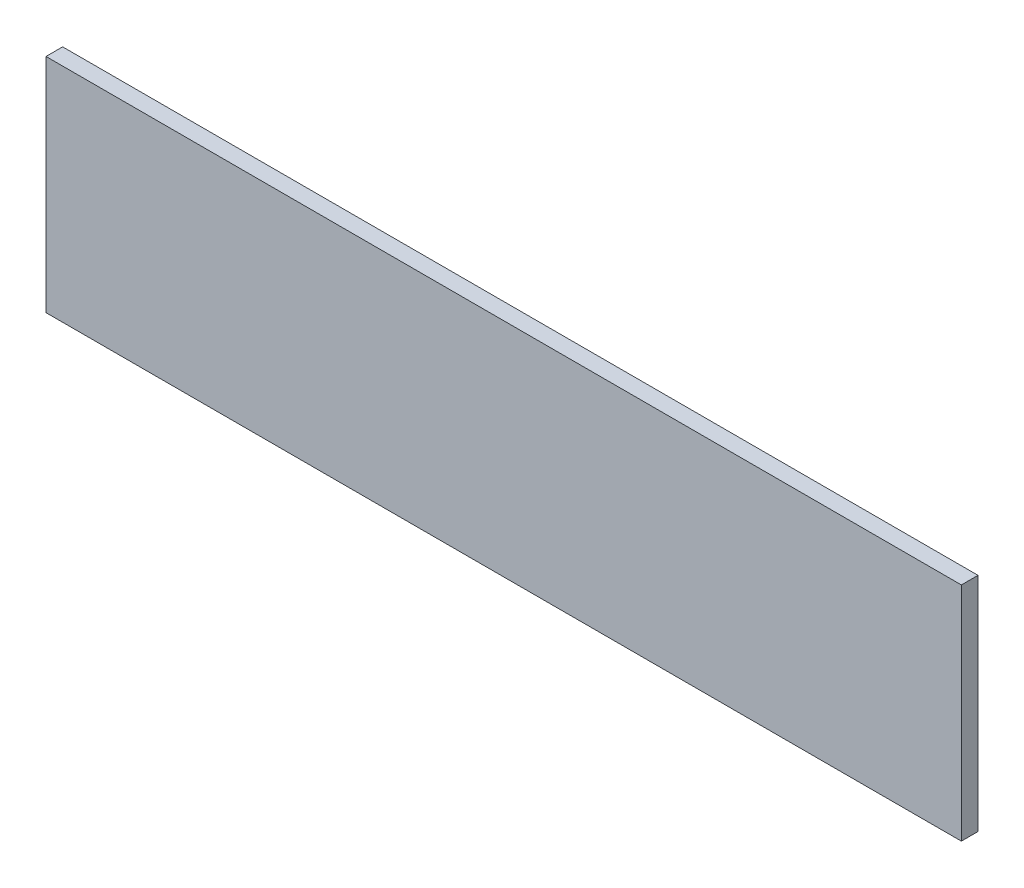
ISO-10303-21;
HEADER;
FILE_DESCRIPTION(('STEP AP214'),'2;1');
FILE_NAME('part.step','',(''),(''),'','','');
FILE_SCHEMA(('AUTOMOTIVE_DESIGN { 1 0 10303 214 1 1 1 1 }'));
ENDSEC;
DATA;
#1=APPLICATION_CONTEXT('core data for automotive mechanical design processes');
#2=APPLICATION_PROTOCOL_DEFINITION('international standard','automotive_design',2000,#1);
#3=PRODUCT_CONTEXT('',#1,'mechanical');
#4=PRODUCT('Part','Part','',(#3));
#5=PRODUCT_RELATED_PRODUCT_CATEGORY('part','',(#4));
#6=PRODUCT_DEFINITION_FORMATION('','',#4);
#7=PRODUCT_DEFINITION_CONTEXT('part definition',#1,'design');
#8=PRODUCT_DEFINITION('design','',#6,#7);
#9=PRODUCT_DEFINITION_SHAPE('','',#8);
#10=(LENGTH_UNIT() NAMED_UNIT(*) SI_UNIT(.MILLI.,.METRE.));
#11=(NAMED_UNIT(*) PLANE_ANGLE_UNIT() SI_UNIT($,.RADIAN.));
#12=(NAMED_UNIT(*) SI_UNIT($,.STERADIAN.) SOLID_ANGLE_UNIT());
#13=UNCERTAINTY_MEASURE_WITH_UNIT(LENGTH_MEASURE(1.E-05),#10,'distance_accuracy_value','');
#14=(GEOMETRIC_REPRESENTATION_CONTEXT(3) GLOBAL_UNCERTAINTY_ASSIGNED_CONTEXT((#13)) GLOBAL_UNIT_ASSIGNED_CONTEXT((#10,
#11,#12)) REPRESENTATION_CONTEXT('',''));
#15=CARTESIAN_POINT('',(0.,0.,0.));
#16=DIRECTION('',(0.,0.,1.));
#17=DIRECTION('',(1.,0.,0.));
#18=AXIS2_PLACEMENT_3D('',#15,#16,#17);
#19=CARTESIAN_POINT('',(82.5,-20.,3.));
#20=DIRECTION('',(-1.,0.,0.));
#21=DIRECTION('',(0.,0.,1.));
#22=AXIS2_PLACEMENT_3D('',#19,#20,#21);
#23=PLANE('',#22);
#24=DIRECTION('',(0.,1.,0.));
#25=VECTOR('',#24,1.);
#26=CARTESIAN_POINT('',(82.5,-20.,0.));
#27=LINE('',#26,#25);
#28=CARTESIAN_POINT('',(82.5,-20.,0.));
#29=VERTEX_POINT('',#28);
#30=CARTESIAN_POINT('',(82.5,20.,0.));
#31=VERTEX_POINT('',#30);
#32=EDGE_CURVE('E97',#29,#31,#27,.T.);
#33=ORIENTED_EDGE('',*,*,#32,.T.);
#34=DIRECTION('',(0.,0.,-1.));
#35=VECTOR('',#34,1.);
#36=CARTESIAN_POINT('',(82.5,20.,3.));
#37=LINE('',#36,#35);
#38=CARTESIAN_POINT('',(82.5,20.,3.));
#39=VERTEX_POINT('',#38);
#40=EDGE_CURVE('E11',#39,#31,#37,.T.);
#41=ORIENTED_EDGE('',*,*,#40,.F.);
#42=DIRECTION('',(0.,1.,0.));
#43=VECTOR('',#42,1.);
#44=CARTESIAN_POINT('',(82.5,-20.,3.));
#45=LINE('',#44,#43);
#46=CARTESIAN_POINT('',(82.5,-20.,3.));
#47=VERTEX_POINT('',#46);
#48=EDGE_CURVE('E85',#47,#39,#45,.T.);
#49=ORIENTED_EDGE('',*,*,#48,.F.);
#50=DIRECTION('',(0.,0.,-1.));
#51=VECTOR('',#50,1.);
#52=CARTESIAN_POINT('',(82.5,-20.,3.));
#53=LINE('',#52,#51);
#54=EDGE_CURVE('E93',#47,#29,#53,.T.);
#55=ORIENTED_EDGE('',*,*,#54,.T.);
#56=EDGE_LOOP('',(#33,#41,#49,#55));
#57=FACE_BOUND('',#56,.T.);
#58=ADVANCED_FACE('F34',(#57),#23,.F.);
#59=CARTESIAN_POINT('',(-82.5,20.,3.));
#60=DIRECTION('',(0.,-1.,0.));
#61=DIRECTION('',(0.,0.,-1.));
#62=AXIS2_PLACEMENT_3D('',#59,#60,#61);
#63=PLANE('',#62);
#64=DIRECTION('',(-1.,0.,0.));
#65=VECTOR('',#64,1.);
#66=CARTESIAN_POINT('',(-82.5,20.,0.));
#67=LINE('',#66,#65);
#68=CARTESIAN_POINT('',(-82.5,20.,0.));
#69=VERTEX_POINT('',#68);
#70=EDGE_CURVE('E89',#31,#69,#67,.T.);
#71=ORIENTED_EDGE('',*,*,#70,.T.);
#72=DIRECTION('',(0.,0.,-1.));
#73=VECTOR('',#72,1.);
#74=CARTESIAN_POINT('',(-82.5,20.,3.));
#75=LINE('',#74,#73);
#76=CARTESIAN_POINT('',(-82.5,20.,3.));
#77=VERTEX_POINT('',#76);
#78=EDGE_CURVE('E42',#77,#69,#75,.T.);
#79=ORIENTED_EDGE('',*,*,#78,.F.);
#80=DIRECTION('',(-1.,0.,0.));
#81=VECTOR('',#80,1.);
#82=CARTESIAN_POINT('',(-82.5,20.,3.));
#83=LINE('',#82,#81);
#84=EDGE_CURVE('E80',#39,#77,#83,.T.);
#85=ORIENTED_EDGE('',*,*,#84,.F.);
#86=ORIENTED_EDGE('',*,*,#40,.T.);
#87=EDGE_LOOP('',(#71,#79,#85,#86));
#88=FACE_BOUND('',#87,.T.);
#89=ADVANCED_FACE('F88',(#88),#63,.F.);
#90=CARTESIAN_POINT('',(-82.5,-20.,3.));
#91=DIRECTION('',(1.,0.,0.));
#92=DIRECTION('',(0.,0.,-1.));
#93=AXIS2_PLACEMENT_3D('',#90,#91,#92);
#94=PLANE('',#93);
#95=DIRECTION('',(0.,-1.,0.));
#96=VECTOR('',#95,1.);
#97=CARTESIAN_POINT('',(-82.5,-20.,0.));
#98=LINE('',#97,#96);
#99=CARTESIAN_POINT('',(-82.5,-20.,0.));
#100=VERTEX_POINT('',#99);
#101=EDGE_CURVE('E67',#69,#100,#98,.T.);
#102=ORIENTED_EDGE('',*,*,#101,.T.);
#103=DIRECTION('',(0.,0.,-1.));
#104=VECTOR('',#103,1.);
#105=CARTESIAN_POINT('',(-82.5,-20.,3.));
#106=LINE('',#105,#104);
#107=CARTESIAN_POINT('',(-82.5,-20.,3.));
#108=VERTEX_POINT('',#107);
#109=EDGE_CURVE('E90',#108,#100,#106,.T.);
#110=ORIENTED_EDGE('',*,*,#109,.F.);
#111=DIRECTION('',(0.,-1.,0.));
#112=VECTOR('',#111,1.);
#113=CARTESIAN_POINT('',(-82.5,-20.,3.));
#114=LINE('',#113,#112);
#115=EDGE_CURVE('E83',#77,#108,#114,.T.);
#116=ORIENTED_EDGE('',*,*,#115,.F.);
#117=ORIENTED_EDGE('',*,*,#78,.T.);
#118=EDGE_LOOP('',(#102,#110,#116,#117));
#119=FACE_BOUND('',#118,.T.);
#120=ADVANCED_FACE('F91',(#119),#94,.F.);
#121=CARTESIAN_POINT('',(-82.5,-20.,3.));
#122=DIRECTION('',(0.,1.,0.));
#123=DIRECTION('',(0.,0.,1.));
#124=AXIS2_PLACEMENT_3D('',#121,#122,#123);
#125=PLANE('',#124);
#126=DIRECTION('',(1.,0.,0.));
#127=VECTOR('',#126,1.);
#128=CARTESIAN_POINT('',(-82.5,-20.,0.));
#129=LINE('',#128,#127);
#130=EDGE_CURVE('E73',#100,#29,#129,.T.);
#131=ORIENTED_EDGE('',*,*,#130,.T.);
#132=ORIENTED_EDGE('',*,*,#54,.F.);
#133=DIRECTION('',(1.,0.,0.));
#134=VECTOR('',#133,1.);
#135=CARTESIAN_POINT('',(-82.5,-20.,3.));
#136=LINE('',#135,#134);
#137=EDGE_CURVE('E50',#108,#47,#136,.T.);
#138=ORIENTED_EDGE('',*,*,#137,.F.);
#139=ORIENTED_EDGE('',*,*,#109,.T.);
#140=EDGE_LOOP('',(#131,#132,#138,#139));
#141=FACE_BOUND('',#140,.T.);
#142=ADVANCED_FACE('F104',(#141),#125,.F.);
#143=CARTESIAN_POINT('',(0.,0.,3.));
#144=DIRECTION('',(0.,0.,-1.));
#145=DIRECTION('',(-1.,0.,0.));
#146=AXIS2_PLACEMENT_3D('',#143,#144,#145);
#147=PLANE('',#146);
#148=ORIENTED_EDGE('',*,*,#48,.T.);
#149=ORIENTED_EDGE('',*,*,#84,.T.);
#150=ORIENTED_EDGE('',*,*,#115,.T.);
#151=ORIENTED_EDGE('',*,*,#137,.T.);
#152=EDGE_LOOP('',(#148,#149,#150,#151));
#153=FACE_BOUND('',#152,.T.);
#154=ADVANCED_FACE('F81',(#153),#147,.F.);
#155=CARTESIAN_POINT('',(0.,0.,0.));
#156=DIRECTION('',(0.,0.,-1.));
#157=DIRECTION('',(-1.,0.,0.));
#158=AXIS2_PLACEMENT_3D('',#155,#156,#157);
#159=PLANE('',#158);
#160=ORIENTED_EDGE('',*,*,#32,.F.);
#161=ORIENTED_EDGE('',*,*,#130,.F.);
#162=ORIENTED_EDGE('',*,*,#101,.F.);
#163=ORIENTED_EDGE('',*,*,#70,.F.);
#164=EDGE_LOOP('',(#160,#161,#162,#163));
#165=FACE_BOUND('',#164,.T.);
#166=ADVANCED_FACE('F107',(#165),#159,.T.);
#167=CLOSED_SHELL('',(#58,#89,#120,#142,#154,#166));
#168=MANIFOLD_SOLID_BREP('B2',#167);
#169=ADVANCED_BREP_SHAPE_REPRESENTATION('',(#18,#168),#14);
#170=SHAPE_DEFINITION_REPRESENTATION(#9,#169);
ENDSEC;
END-ISO-10303-21;
